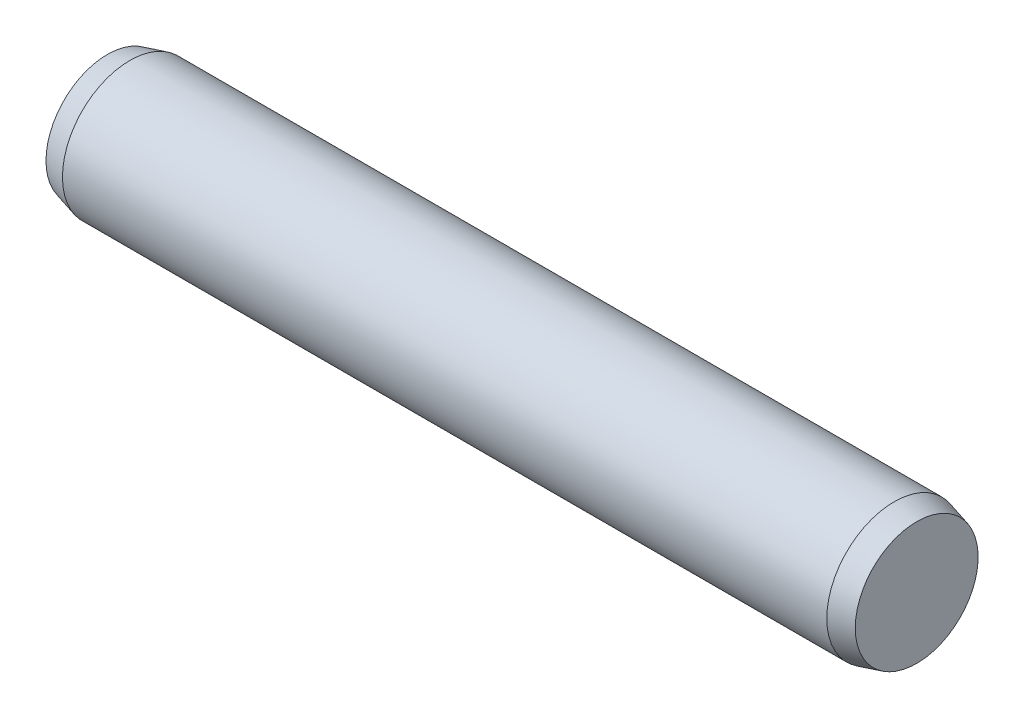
from build123d import *


with BuildPart() as part:
    # Sketch1 → Base-Revolve (revolve)
    with BuildSketch(Plane.XY, mode=Mode.PRIVATE) as base_revolve_sk:
        Polygon((0, 0), (18, 0), (18, 1.366025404), (17.5, 1.5), (0.5, 1.5), (0, 1.366025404), align=None)
    revolve(base_revolve_sk.sketch.rotate(Axis((-6.35, 0, 0), (1, 0, 0)), 90), axis=Axis((-6.35, 0, 0), (1, 0, 0)))


solid = part.part
